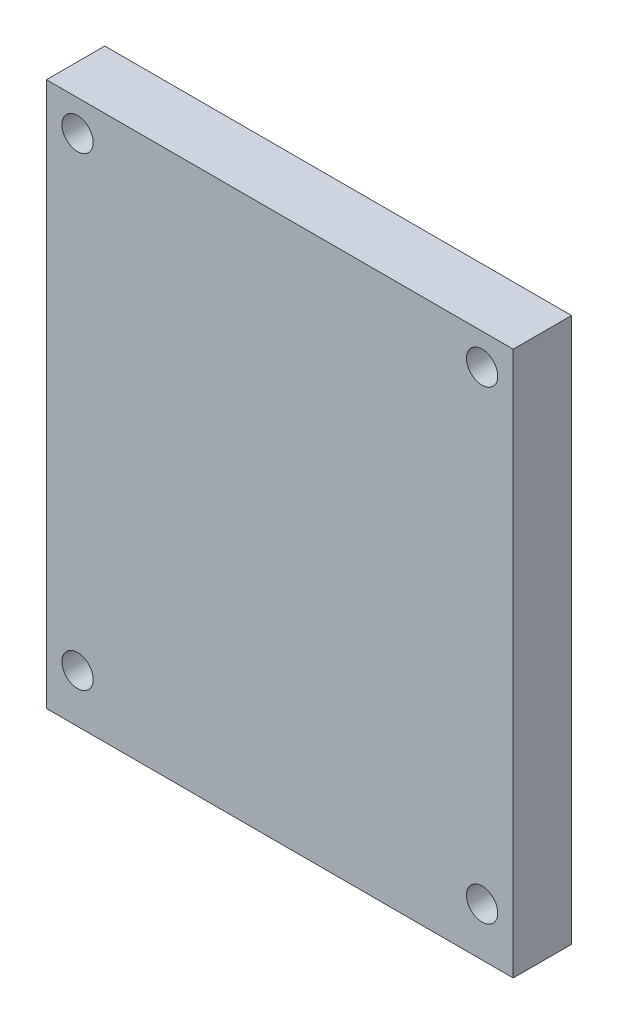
from build123d import *

# Parameters (mm, degrees)
SKETCH1_W                  = 76.2
SKETCH1_H                  = 88.9
BOSS_EXTRUDE1_DEPTH        = 9.525
F_10_CLEARANCE_HOLE1_D     = 5.1054
F_10_CLEARANCE_HOLE1_DEPTH = 12.7
F_10_CLEARANCE_HOLE1_TIP   = 1.533816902


with BuildPart() as part:
    # Sketch1 → Boss-Extrude1 (new body)
    with BuildSketch(Plane.XY):
        with Locations((38.1, 44.45)):
            Rectangle(SKETCH1_W, SKETCH1_H)
    extrude(amount=BOSS_EXTRUDE1_DEPTH)

    # 10 Clearance Hole1
    with Locations(Plane.XY.offset(9.525)):
        with Locations((71.12, 83.82), (5.08, 83.82), (5.08, 7.9121), (71.12, 7.9121)):
            Hole(F_10_CLEARANCE_HOLE1_D / 2, depth=F_10_CLEARANCE_HOLE1_DEPTH)
            with Locations((0, 0, -(F_10_CLEARANCE_HOLE1_DEPTH + F_10_CLEARANCE_HOLE1_TIP / 2))):  # 118° drill point
                Cone(0, F_10_CLEARANCE_HOLE1_D / 2, F_10_CLEARANCE_HOLE1_TIP, mode=Mode.SUBTRACT)


solid = part.part
